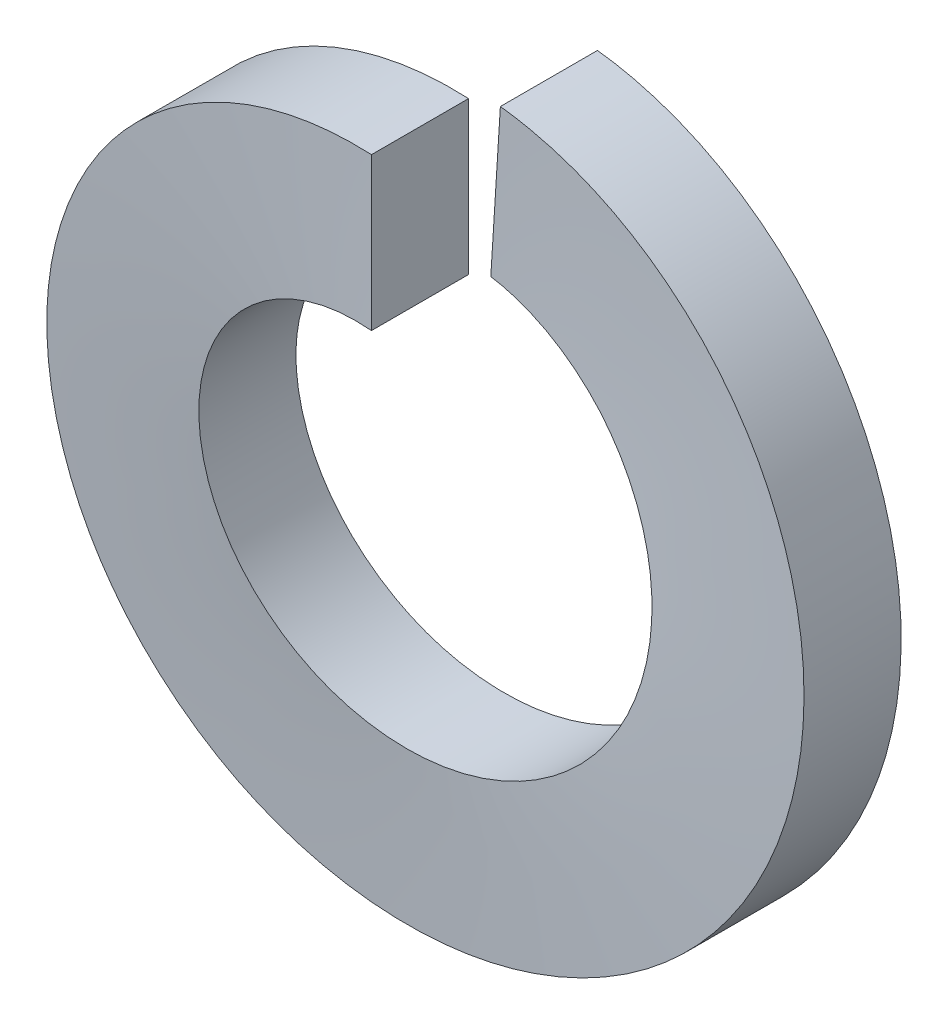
from build123d import *

# Parameters (mm, degrees)
SWEEP1_PITCH       = 2.652888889
SWEEP1_HEIGHT      = 2.62636
SWEEP1_RADIUS      = 8.636
SWEEP1_START_ANGLE = 90
SKETCH2_W          = 2.3876
SKETCH2_H          = 3.7465


with BuildPart() as part:
    # Sweep1: sweep along a helix
    with BuildLine() as sweep1_path:
        add(Helix(SWEEP1_PITCH, SWEEP1_HEIGHT, SWEEP1_RADIUS, center=(0, 0, 0), direction=(0, 0, -1), lefthand=True, mode=Mode.PRIVATE).rotate(Axis((0, 0, 0), (0, 0, -1)), SWEEP1_START_ANGLE))
    # Sketch2 → Sweep1 (sweep)
    with BuildSketch(Plane(origin=(0, 0, 0), x_dir=(0, 0, -1), z_dir=(1, 0, 0))):
        with Locations((-1.1938, 6.76275)):
            Rectangle(SKETCH2_W, SKETCH2_H)
    sweep(path=sweep1_path.line, is_frenet=True)


solid = part.part
